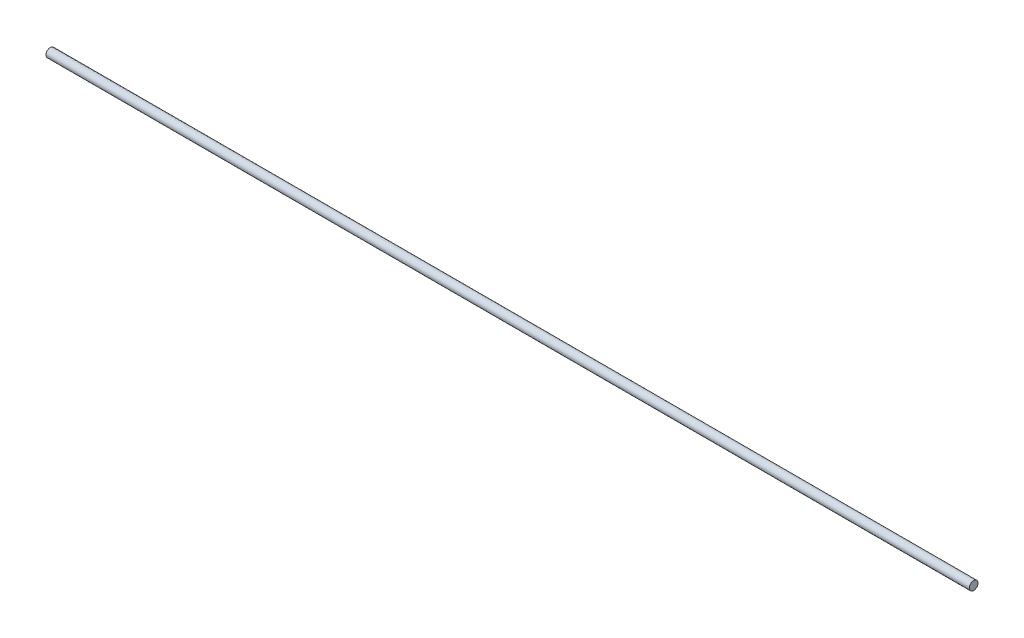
ISO-10303-21;
HEADER;
FILE_DESCRIPTION(('STEP AP214'),'2;1');
FILE_NAME('part.step','',(''),(''),'','','');
FILE_SCHEMA(('AUTOMOTIVE_DESIGN { 1 0 10303 214 1 1 1 1 }'));
ENDSEC;
DATA;
#1=APPLICATION_CONTEXT('core data for automotive mechanical design processes');
#2=APPLICATION_PROTOCOL_DEFINITION('international standard','automotive_design',2000,#1);
#3=PRODUCT_CONTEXT('',#1,'mechanical');
#4=PRODUCT('Part','Part','',(#3));
#5=PRODUCT_RELATED_PRODUCT_CATEGORY('part','',(#4));
#6=PRODUCT_DEFINITION_FORMATION('','',#4);
#7=PRODUCT_DEFINITION_CONTEXT('part definition',#1,'design');
#8=PRODUCT_DEFINITION('design','',#6,#7);
#9=PRODUCT_DEFINITION_SHAPE('','',#8);
#10=(LENGTH_UNIT() NAMED_UNIT(*) SI_UNIT(.MILLI.,.METRE.));
#11=(NAMED_UNIT(*) PLANE_ANGLE_UNIT() SI_UNIT($,.RADIAN.));
#12=(NAMED_UNIT(*) SI_UNIT($,.STERADIAN.) SOLID_ANGLE_UNIT());
#13=UNCERTAINTY_MEASURE_WITH_UNIT(LENGTH_MEASURE(1.E-05),#10,'distance_accuracy_value','');
#14=(GEOMETRIC_REPRESENTATION_CONTEXT(3) GLOBAL_UNCERTAINTY_ASSIGNED_CONTEXT((#13)) GLOBAL_UNIT_ASSIGNED_CONTEXT((#10,
#11,#12)) REPRESENTATION_CONTEXT('',''));
#15=CARTESIAN_POINT('',(0.,0.,0.));
#16=DIRECTION('',(0.,0.,1.));
#17=DIRECTION('',(1.,0.,0.));
#18=AXIS2_PLACEMENT_3D('',#15,#16,#17);
#19=CARTESIAN_POINT('',(90.,0.,0.));
#20=DIRECTION('',(-1.,0.,0.));
#21=DIRECTION('',(0.,0.,1.));
#22=AXIS2_PLACEMENT_3D('',#19,#20,#21);
#23=CYLINDRICAL_SURFACE('',#22,0.425);
#24=CARTESIAN_POINT('',(90.,0.,0.));
#25=DIRECTION('',(1.,0.,0.));
#26=DIRECTION('',(0.,0.,-1.));
#27=AXIS2_PLACEMENT_3D('',#24,#25,#26);
#28=CIRCLE('',#27,0.425);
#29=CARTESIAN_POINT('',(90.,0.,-0.425));
#30=VERTEX_POINT('',#29);
#31=EDGE_CURVE('E10',#30,#30,#28,.T.);
#32=ORIENTED_EDGE('',*,*,#31,.F.);
#33=EDGE_LOOP('',(#32));
#34=FACE_BOUND('',#33,.T.);
#35=CARTESIAN_POINT('',(0.,0.,0.));
#36=DIRECTION('',(1.,0.,0.));
#37=DIRECTION('',(0.,0.,-1.));
#38=AXIS2_PLACEMENT_3D('',#35,#36,#37);
#39=CIRCLE('',#38,0.425);
#40=CARTESIAN_POINT('',(0.,0.,-0.425));
#41=VERTEX_POINT('',#40);
#42=EDGE_CURVE('E30',#41,#41,#39,.T.);
#43=ORIENTED_EDGE('',*,*,#42,.T.);
#44=EDGE_LOOP('',(#43));
#45=FACE_BOUND('',#44,.T.);
#46=ADVANCED_FACE('F24',(#34,#45),#23,.T.);
#47=CARTESIAN_POINT('',(90.,0.,0.));
#48=DIRECTION('',(1.,0.,0.));
#49=DIRECTION('',(0.,0.,-1.));
#50=AXIS2_PLACEMENT_3D('',#47,#48,#49);
#51=PLANE('',#50);
#52=ORIENTED_EDGE('',*,*,#31,.T.);
#53=EDGE_LOOP('',(#52));
#54=FACE_BOUND('',#53,.T.);
#55=ADVANCED_FACE('F39',(#54),#51,.T.);
#56=CARTESIAN_POINT('',(0.,0.,0.));
#57=DIRECTION('',(1.,0.,0.));
#58=DIRECTION('',(0.,0.,-1.));
#59=AXIS2_PLACEMENT_3D('',#56,#57,#58);
#60=PLANE('',#59);
#61=ORIENTED_EDGE('',*,*,#42,.F.);
#62=EDGE_LOOP('',(#61));
#63=FACE_BOUND('',#62,.T.);
#64=ADVANCED_FACE('F37',(#63),#60,.F.);
#65=CLOSED_SHELL('',(#46,#55,#64));
#66=MANIFOLD_SOLID_BREP('B2',#65);
#67=ADVANCED_BREP_SHAPE_REPRESENTATION('',(#18,#66),#14);
#68=SHAPE_DEFINITION_REPRESENTATION(#9,#67);
ENDSEC;
END-ISO-10303-21;
